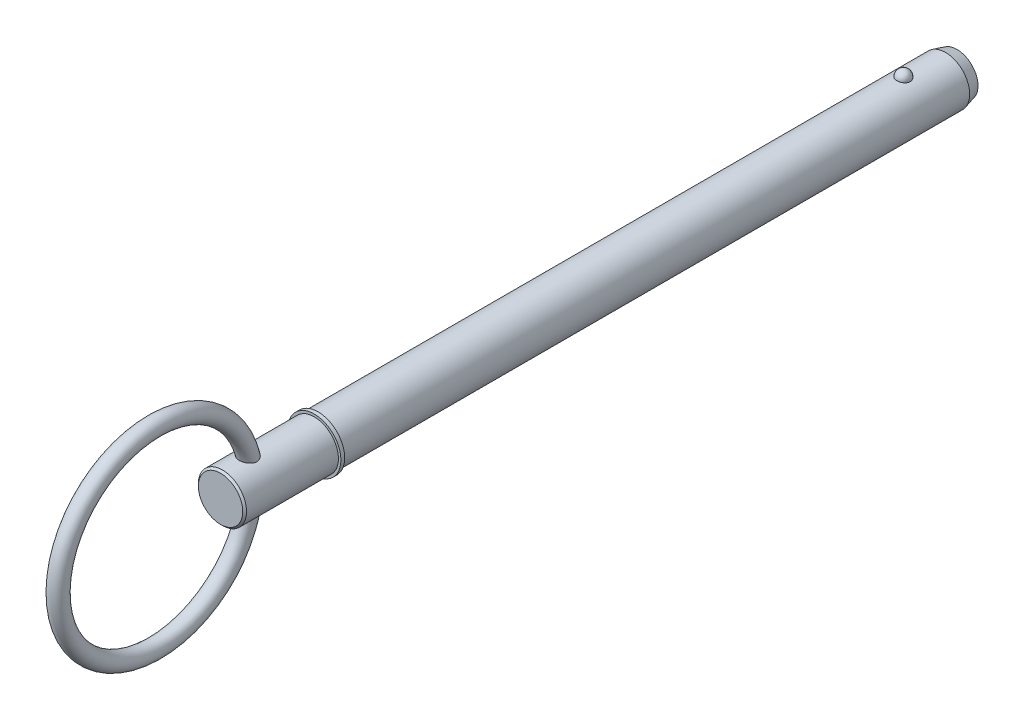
from build123d import *

# Parameters (mm, degrees)
SKETCH2_R           = 6.35
BOSS_EXTRUDE1_DEPTH = 152.4
BOSS_EXTRUDE2_START = 15.88
SKETCH3_R           = 6.35
BOSS_EXTRUDE2_DEPTH = 15.88
CHAMFER1_SIZE       = 3
CHAMFER1_SIZE2      = 0.803847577
SKETCH20_W          = 1
SKETCH20_H          = 7
SKETCH21_R          = 6.35
BOSS_EXTRUDE3_DEPTH = 25.7
CHAMFER2_SIZE       = 0.5
SKETCH24_R          = 2.25


with BuildPart() as part:
    # Sketch2 → Boss-Extrude1 (new body)
    with BuildSketch(Plane.XY):
        with Locations(Location((0, 0, 0), (0, 0, 180))):
            Circle(SKETCH2_R)
    extrude(amount=BOSS_EXTRUDE1_DEPTH)

    # Sketch3 → Boss-Extrude2 (add)
    with BuildSketch(Plane(origin=(0, 0, 0), x_dir=(-1, 0, 0), z_dir=(0, 0, -1)).offset(BOSS_EXTRUDE2_START)):
        Circle(SKETCH3_R)
    extrude(amount=-BOSS_EXTRUDE2_DEPTH)

    # Chamfer1
    chamfer1_edges = [part.edges().sort_by_distance(p)[0] for p in [
        (6.35, 0, -15.88),
    ]]
    chamfer1_side = [part.faces().sort_by_distance(p)[0] for p in [
        (6.35, 0, 68.26),
    ]]
    chamfer(chamfer1_edges, length=CHAMFER1_SIZE, length2=CHAMFER1_SIZE2, reference=chamfer1_side[0])

    # Sketch18 → Revolve1 (revolve)
    with BuildSketch(Plane(origin=(0, 0, 0), x_dir=(0, 0, -1), z_dir=(1, 0, 0))):
        with BuildLine():
            Line((1.78, 8.13), (1.78, 4.57))
            ThreePointArc((1.78, 4.57), (0, 6.35), (1.78, 8.13))
        make_face()
    revolve(axis=Axis((0, 8.13, -1.78), (0, -1, 0)))

    # Sketch20 → Revolve2 (revolve)
    with BuildSketch(Plane(origin=(0, 0, 0), x_dir=(0, 0, -1), z_dir=(1, 0, 0)), mode=Mode.PRIVATE) as revolve2_sk:
        with Locations((-152.9, 3.5)):
            Rectangle(SKETCH20_W, SKETCH20_H)
    revolve(revolve2_sk.sketch.rotate(Axis((0, 0, 33.728787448), (0, 0, 1)), 270), axis=Axis((0, 0, 33.728787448), (0, 0, 1)))

    # Sketch21 → Boss-Extrude3 (add)
    with BuildSketch(Plane(origin=(0, 0, 152.4), x_dir=(-1, 0, 0), z_dir=(0, 0, -1))):
        with Locations(Location((0, 0, 0), (0, 0, 180))):
            Circle(SKETCH21_R)
    extrude(amount=-BOSS_EXTRUDE3_DEPTH)

    # Chamfer2
    chamfer2_edges = [part.edges().sort_by_distance(p)[0] for p in [
        (-6.35, 0, 178.1),
    ]]
    chamfer(chamfer2_edges, length=CHAMFER2_SIZE)

    # Sweep1: sweep along a path in Sketch23
    with BuildLine(Plane(origin=(0, 0, 0), x_dir=(0, 0, -1), z_dir=(1, 0, 0))) as sweep1_path:
        CenterArc((-195.5, 0), 25.4, 0, 360)
    # Sketch24 → Sweep1 (sweep)
    with BuildSketch(Plane(origin=(0, 0, 0), x_dir=(1, 0, 0), z_dir=(0, 1, 0))):
        with Locations((0, -170.1)):
            Circle(SKETCH24_R)
    sweep(path=sweep1_path.line)


solid = part.part
